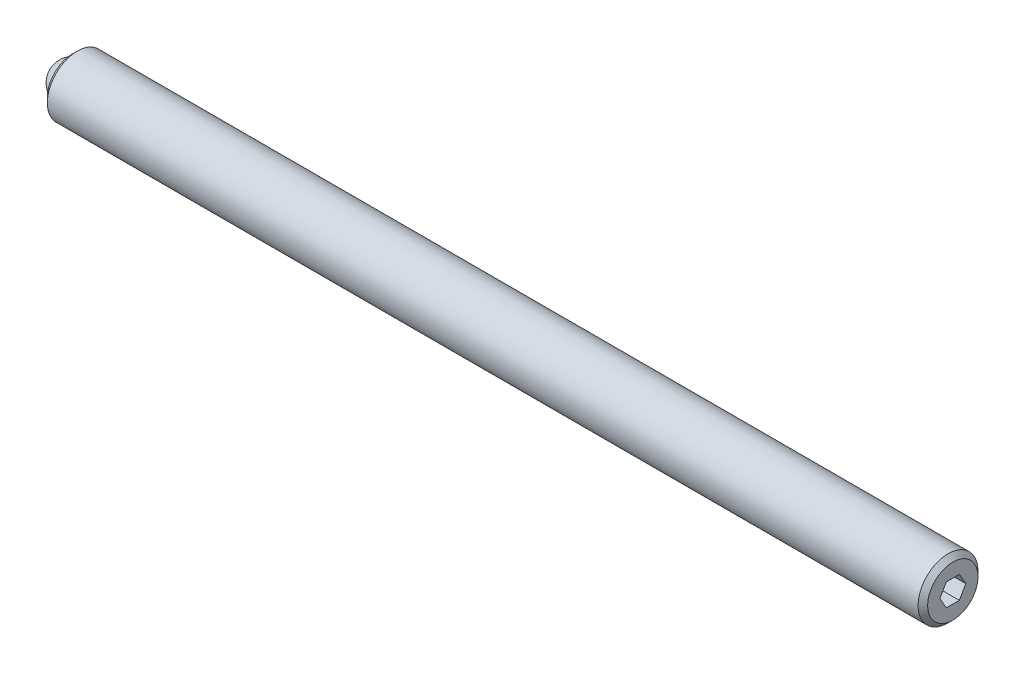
from build123d import *

# Parameters (mm, degrees)
SKETCH2_R           = 3.175
BOSS_EXTRUDE1_DEPTH = 93.265625
CHAMFER1_SIZE       = 0.508
CHAMFER2_SIZE       = 0.508
CUT_EXTRUDE2_DEPTH  = 2.286
SKETCH3_R           = 1.9812
CUT_EXTRUDE3_DEPTH  = 1.984375


with BuildPart() as part:
    # Sketch2 → Boss-Extrude1 (new body)
    with BuildSketch(Plane(origin=(0, 0, 0), x_dir=(0, 0, -1), z_dir=(1, 0, 0))):
        with Locations(Location((0, 0, 0), (0, 0, 180))):
            Circle(SKETCH2_R)
    extrude(amount=BOSS_EXTRUDE1_DEPTH)

    # Chamfer1
    chamfer1_edges = [part.edges().sort_by_distance(p)[0] for p in [
        (0, 0, -3.175),
    ]]
    chamfer(chamfer1_edges, length=CHAMFER1_SIZE)

    # Chamfer2
    chamfer2_edges = [part.edges().sort_by_distance(p)[0] for p in [
        (93.265625, 0, -3.175),
    ]]
    chamfer(chamfer2_edges, length=CHAMFER2_SIZE)

    # Sketch4 → Cut-Extrude2 (cut)
    with BuildSketch(Plane(origin=(93.265625, 0, 0), x_dir=(0, 0, -1), z_dir=(1, 0, 0))):
        Polygon((1.374815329, 0), (0.687407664, 1.190625), (-0.687407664, 1.190625), (-1.374815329, 0), (-0.687407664, -1.190625), (0.687407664, -1.190625), align=None)
    extrude(amount=-CUT_EXTRUDE2_DEPTH, mode=Mode.SUBTRACT)

    # Sketch3 → Cut-Extrude3 (cut)
    with BuildSketch(Plane.ZY):
        Circle(SKETCH3_R)
    extrude(amount=-CUT_EXTRUDE3_DEPTH, mode=Mode.SUBTRACT)


with BuildPart() as body_2:
    # Sketch5 → Revolve1 (revolve)
    with BuildSketch(Plane.ZY):
        with BuildLine():
            Line((0, 0), (0, -1.984375))
            ThreePointArc((0, -1.984375), (-1.984375, 0), (0, 1.984375))
            Line((0, 1.984375), (0, 0))
        make_face()
    revolve(axis=Axis((0, 0, 0), (0, 1, 0)))


solid = Compound([part.part, body_2.part])
